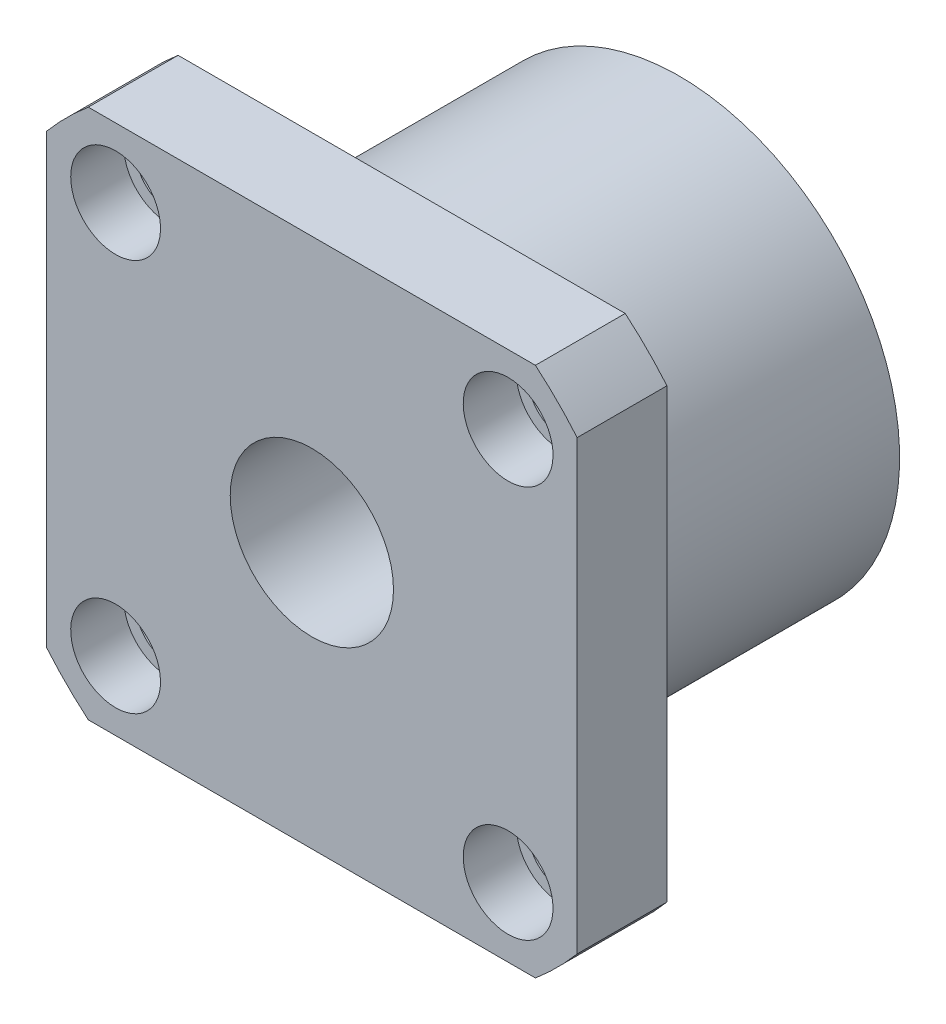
ISO-10303-21;
HEADER;
FILE_DESCRIPTION(('STEP AP214'),'2;1');
FILE_NAME('part.step','',(''),(''),'','','');
FILE_SCHEMA(('AUTOMOTIVE_DESIGN { 1 0 10303 214 1 1 1 1 }'));
ENDSEC;
DATA;
#1=APPLICATION_CONTEXT('core data for automotive mechanical design processes');
#2=APPLICATION_PROTOCOL_DEFINITION('international standard','automotive_design',2000,#1);
#3=PRODUCT_CONTEXT('',#1,'mechanical');
#4=PRODUCT('Part','Part','',(#3));
#5=PRODUCT_RELATED_PRODUCT_CATEGORY('part','',(#4));
#6=PRODUCT_DEFINITION_FORMATION('','',#4);
#7=PRODUCT_DEFINITION_CONTEXT('part definition',#1,'design');
#8=PRODUCT_DEFINITION('design','',#6,#7);
#9=PRODUCT_DEFINITION_SHAPE('','',#8);
#10=(LENGTH_UNIT() NAMED_UNIT(*) SI_UNIT(.MILLI.,.METRE.));
#11=(NAMED_UNIT(*) PLANE_ANGLE_UNIT() SI_UNIT($,.RADIAN.));
#12=(NAMED_UNIT(*) SI_UNIT($,.STERADIAN.) SOLID_ANGLE_UNIT());
#13=UNCERTAINTY_MEASURE_WITH_UNIT(LENGTH_MEASURE(1.E-05),#10,'distance_accuracy_value','');
#14=(GEOMETRIC_REPRESENTATION_CONTEXT(3) GLOBAL_UNCERTAINTY_ASSIGNED_CONTEXT((#13)) GLOBAL_UNIT_ASSIGNED_CONTEXT((#10,
#11,#12)) REPRESENTATION_CONTEXT('',''));
#15=CARTESIAN_POINT('',(0.,0.,0.));
#16=DIRECTION('',(0.,0.,1.));
#17=DIRECTION('',(1.,0.,0.));
#18=AXIS2_PLACEMENT_3D('',#15,#16,#17);
#19=CARTESIAN_POINT('',(0.,0.,0.));
#20=DIRECTION('',(0.,0.,-1.));
#21=DIRECTION('',(-1.,0.,0.));
#22=AXIS2_PLACEMENT_3D('',#19,#20,#21);
#23=PLANE('',#22);
#24=CARTESIAN_POINT('',(-24.041630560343,-24.0416305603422,0.));
#25=DIRECTION('',(0.,0.,-1.));
#26=DIRECTION('',(0.,-1.,0.));
#27=AXIS2_PLACEMENT_3D('',#24,#25,#26);
#28=CIRCLE('',#27,4.);
#29=CARTESIAN_POINT('',(-24.041630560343,-28.0416305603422,0.));
#30=VERTEX_POINT('',#29);
#31=EDGE_CURVE('E156',#30,#30,#28,.T.);
#32=ORIENTED_EDGE('',*,*,#31,.F.);
#33=EDGE_LOOP('',(#32));
#34=FACE_BOUND('',#33,.T.);
#35=CARTESIAN_POINT('',(24.0416305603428,24.0416305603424,0.));
#36=DIRECTION('',(0.,0.,-1.));
#37=DIRECTION('',(0.,1.,0.));
#38=AXIS2_PLACEMENT_3D('',#35,#36,#37);
#39=CIRCLE('',#38,4.);
#40=CARTESIAN_POINT('',(24.0416305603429,28.0416305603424,0.));
#41=VERTEX_POINT('',#40);
#42=EDGE_CURVE('E190',#41,#41,#39,.T.);
#43=ORIENTED_EDGE('',*,*,#42,.F.);
#44=EDGE_LOOP('',(#43));
#45=FACE_BOUND('',#44,.T.);
#46=CARTESIAN_POINT('',(0.,0.,0.));
#47=DIRECTION('',(0.,0.,-1.));
#48=DIRECTION('',(-1.,0.,0.));
#49=AXIS2_PLACEMENT_3D('',#46,#47,#48);
#50=CIRCLE('',#49,42.5);
#51=CARTESIAN_POINT('',(32.5,-27.3861278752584,0.));
#52=VERTEX_POINT('',#51);
#53=CARTESIAN_POINT('',(27.3861278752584,-32.5,0.));
#54=VERTEX_POINT('',#53);
#55=EDGE_CURVE('E80',#52,#54,#50,.T.);
#56=ORIENTED_EDGE('',*,*,#55,.T.);
#57=DIRECTION('',(1.,0.,0.));
#58=VECTOR('',#57,1.);
#59=CARTESIAN_POINT('',(-27.3861278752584,-32.5,0.));
#60=LINE('',#59,#58);
#61=CARTESIAN_POINT('',(-27.3861278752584,-32.5,0.));
#62=VERTEX_POINT('',#61);
#63=EDGE_CURVE('E94',#62,#54,#60,.T.);
#64=ORIENTED_EDGE('',*,*,#63,.F.);
#65=CARTESIAN_POINT('',(0.,0.,0.));
#66=DIRECTION('',(0.,0.,1.));
#67=DIRECTION('',(1.,0.,0.));
#68=AXIS2_PLACEMENT_3D('',#65,#66,#67);
#69=CIRCLE('',#68,42.5);
#70=CARTESIAN_POINT('',(-32.5,-27.3861278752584,0.));
#71=VERTEX_POINT('',#70);
#72=EDGE_CURVE('E101',#71,#62,#69,.T.);
#73=ORIENTED_EDGE('',*,*,#72,.F.);
#74=DIRECTION('',(0.,-1.,0.));
#75=VECTOR('',#74,1.);
#76=CARTESIAN_POINT('',(-32.5,27.3861278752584,0.));
#77=LINE('',#76,#75);
#78=CARTESIAN_POINT('',(-32.5,27.3861278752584,0.));
#79=VERTEX_POINT('',#78);
#80=EDGE_CURVE('E103',#79,#71,#77,.T.);
#81=ORIENTED_EDGE('',*,*,#80,.F.);
#82=CARTESIAN_POINT('',(0.,0.,0.));
#83=DIRECTION('',(0.,0.,-1.));
#84=DIRECTION('',(-1.,0.,0.));
#85=AXIS2_PLACEMENT_3D('',#82,#83,#84);
#86=CIRCLE('',#85,42.5);
#87=CARTESIAN_POINT('',(-27.3861278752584,32.5,0.));
#88=VERTEX_POINT('',#87);
#89=EDGE_CURVE('E109',#79,#88,#86,.T.);
#90=ORIENTED_EDGE('',*,*,#89,.T.);
#91=DIRECTION('',(1.,0.,0.));
#92=VECTOR('',#91,1.);
#93=CARTESIAN_POINT('',(-27.3861278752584,32.5,0.));
#94=LINE('',#93,#92);
#95=CARTESIAN_POINT('',(27.3861278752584,32.5,0.));
#96=VERTEX_POINT('',#95);
#97=EDGE_CURVE('E112',#88,#96,#94,.T.);
#98=ORIENTED_EDGE('',*,*,#97,.T.);
#99=CARTESIAN_POINT('',(0.,0.,0.));
#100=DIRECTION('',(0.,0.,1.));
#101=DIRECTION('',(1.,0.,0.));
#102=AXIS2_PLACEMENT_3D('',#99,#100,#101);
#103=CIRCLE('',#102,42.5);
#104=CARTESIAN_POINT('',(32.5,27.3861278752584,0.));
#105=VERTEX_POINT('',#104);
#106=EDGE_CURVE('E115',#105,#96,#103,.T.);
#107=ORIENTED_EDGE('',*,*,#106,.F.);
#108=DIRECTION('',(0.,-1.,0.));
#109=VECTOR('',#108,1.);
#110=CARTESIAN_POINT('',(32.5,27.3861278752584,0.));
#111=LINE('',#110,#109);
#112=EDGE_CURVE('E97',#105,#52,#111,.T.);
#113=ORIENTED_EDGE('',*,*,#112,.T.);
#114=EDGE_LOOP('',(#56,#64,#73,#81,#90,#98,#107,#113));
#115=FACE_BOUND('',#114,.T.);
#116=CARTESIAN_POINT('',(-24.0416305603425,24.0416305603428,0.));
#117=DIRECTION('',(0.,0.,-1.));
#118=DIRECTION('',(-1.,0.,0.));
#119=AXIS2_PLACEMENT_3D('',#116,#117,#118);
#120=CIRCLE('',#119,4.);
#121=CARTESIAN_POINT('',(-28.0416305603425,24.0416305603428,0.));
#122=VERTEX_POINT('',#121);
#123=EDGE_CURVE('E151',#122,#122,#120,.T.);
#124=ORIENTED_EDGE('',*,*,#123,.F.);
#125=EDGE_LOOP('',(#124));
#126=FACE_BOUND('',#125,.T.);
#127=CARTESIAN_POINT('',(24.0416305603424,-24.0416305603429,0.));
#128=DIRECTION('',(0.,0.,-1.));
#129=DIRECTION('',(1.,0.,0.));
#130=AXIS2_PLACEMENT_3D('',#127,#128,#129);
#131=CIRCLE('',#130,4.);
#132=CARTESIAN_POINT('',(28.0416305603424,-24.0416305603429,0.));
#133=VERTEX_POINT('',#132);
#134=EDGE_CURVE('E187',#133,#133,#131,.T.);
#135=ORIENTED_EDGE('',*,*,#134,.F.);
#136=EDGE_LOOP('',(#135));
#137=FACE_BOUND('',#136,.T.);
#138=CARTESIAN_POINT('',(0.,0.,0.));
#139=DIRECTION('',(0.,0.,-1.));
#140=DIRECTION('',(-1.,0.,0.));
#141=AXIS2_PLACEMENT_3D('',#138,#139,#140);
#142=CIRCLE('',#141,27.);
#143=CARTESIAN_POINT('',(-27.,0.,0.));
#144=VERTEX_POINT('',#143);
#145=EDGE_CURVE('E18',#144,#144,#142,.F.);
#146=ORIENTED_EDGE('',*,*,#145,.T.);
#147=EDGE_LOOP('',(#146));
#148=FACE_BOUND('',#147,.T.);
#149=ADVANCED_FACE('F14',(#34,#45,#115,#126,#137,#148),#23,.T.);
#150=CARTESIAN_POINT('',(0.,0.,11.));
#151=DIRECTION('',(0.,0.,-1.));
#152=DIRECTION('',(-1.,0.,0.));
#153=AXIS2_PLACEMENT_3D('',#150,#151,#152);
#154=PLANE('',#153);
#155=CARTESIAN_POINT('',(0.,0.,11.));
#156=DIRECTION('',(0.,0.,1.));
#157=DIRECTION('',(1.,0.,0.));
#158=AXIS2_PLACEMENT_3D('',#155,#156,#157);
#159=CIRCLE('',#158,10.);
#160=CARTESIAN_POINT('',(10.,0.,11.));
#161=VERTEX_POINT('',#160);
#162=EDGE_CURVE('E98',#161,#161,#159,.T.);
#163=ORIENTED_EDGE('',*,*,#162,.F.);
#164=EDGE_LOOP('',(#163));
#165=FACE_BOUND('',#164,.T.);
#166=CARTESIAN_POINT('',(-24.041630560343,-24.0416305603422,11.));
#167=DIRECTION('',(0.,0.,-1.));
#168=DIRECTION('',(0.,-1.,0.));
#169=AXIS2_PLACEMENT_3D('',#166,#167,#168);
#170=CIRCLE('',#169,5.5);
#171=CARTESIAN_POINT('',(-24.0416305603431,-29.5416305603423,11.));
#172=VERTEX_POINT('',#171);
#173=EDGE_CURVE('E171',#172,#172,#170,.T.);
#174=ORIENTED_EDGE('',*,*,#173,.T.);
#175=EDGE_LOOP('',(#174));
#176=FACE_BOUND('',#175,.T.);
#177=CARTESIAN_POINT('',(24.0416305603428,24.0416305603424,11.));
#178=DIRECTION('',(0.,0.,-1.));
#179=DIRECTION('',(0.,1.,0.));
#180=AXIS2_PLACEMENT_3D('',#177,#178,#179);
#181=CIRCLE('',#180,5.5);
#182=CARTESIAN_POINT('',(24.0416305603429,29.5416305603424,11.));
#183=VERTEX_POINT('',#182);
#184=EDGE_CURVE('E160',#183,#183,#181,.T.);
#185=ORIENTED_EDGE('',*,*,#184,.T.);
#186=EDGE_LOOP('',(#185));
#187=FACE_BOUND('',#186,.T.);
#188=CARTESIAN_POINT('',(-24.0416305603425,24.0416305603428,11.));
#189=DIRECTION('',(0.,0.,-1.));
#190=DIRECTION('',(-1.,0.,0.));
#191=AXIS2_PLACEMENT_3D('',#188,#189,#190);
#192=CIRCLE('',#191,5.5);
#193=CARTESIAN_POINT('',(-29.5416305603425,24.0416305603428,11.));
#194=VERTEX_POINT('',#193);
#195=EDGE_CURVE('E193',#194,#194,#192,.T.);
#196=ORIENTED_EDGE('',*,*,#195,.T.);
#197=EDGE_LOOP('',(#196));
#198=FACE_BOUND('',#197,.T.);
#199=CARTESIAN_POINT('',(0.,0.,11.));
#200=DIRECTION('',(0.,0.,-1.));
#201=DIRECTION('',(-1.,0.,0.));
#202=AXIS2_PLACEMENT_3D('',#199,#200,#201);
#203=CIRCLE('',#202,42.5);
#204=CARTESIAN_POINT('',(32.5,-27.3861278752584,11.));
#205=VERTEX_POINT('',#204);
#206=CARTESIAN_POINT('',(27.3861278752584,-32.5,11.));
#207=VERTEX_POINT('',#206);
#208=EDGE_CURVE('E82',#205,#207,#203,.T.);
#209=ORIENTED_EDGE('',*,*,#208,.F.);
#210=DIRECTION('',(0.,-1.,0.));
#211=VECTOR('',#210,1.);
#212=CARTESIAN_POINT('',(32.5,27.3861278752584,11.));
#213=LINE('',#212,#211);
#214=CARTESIAN_POINT('',(32.5,27.3861278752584,11.));
#215=VERTEX_POINT('',#214);
#216=EDGE_CURVE('E88',#215,#205,#213,.T.);
#217=ORIENTED_EDGE('',*,*,#216,.F.);
#218=CARTESIAN_POINT('',(0.,0.,11.));
#219=DIRECTION('',(0.,0.,1.));
#220=DIRECTION('',(1.,0.,0.));
#221=AXIS2_PLACEMENT_3D('',#218,#219,#220);
#222=CIRCLE('',#221,42.5);
#223=CARTESIAN_POINT('',(27.3861278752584,32.5,11.));
#224=VERTEX_POINT('',#223);
#225=EDGE_CURVE('E134',#215,#224,#222,.T.);
#226=ORIENTED_EDGE('',*,*,#225,.T.);
#227=DIRECTION('',(1.,0.,0.));
#228=VECTOR('',#227,1.);
#229=CARTESIAN_POINT('',(-27.3861278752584,32.5,11.));
#230=LINE('',#229,#228);
#231=CARTESIAN_POINT('',(-27.3861278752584,32.5,11.));
#232=VERTEX_POINT('',#231);
#233=EDGE_CURVE('E131',#232,#224,#230,.T.);
#234=ORIENTED_EDGE('',*,*,#233,.F.);
#235=CARTESIAN_POINT('',(0.,0.,11.));
#236=DIRECTION('',(0.,0.,-1.));
#237=DIRECTION('',(-1.,0.,0.));
#238=AXIS2_PLACEMENT_3D('',#235,#236,#237);
#239=CIRCLE('',#238,42.5);
#240=CARTESIAN_POINT('',(-32.5,27.3861278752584,11.));
#241=VERTEX_POINT('',#240);
#242=EDGE_CURVE('E128',#241,#232,#239,.T.);
#243=ORIENTED_EDGE('',*,*,#242,.F.);
#244=DIRECTION('',(0.,-1.,0.));
#245=VECTOR('',#244,1.);
#246=CARTESIAN_POINT('',(-32.5,27.3861278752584,11.));
#247=LINE('',#246,#245);
#248=CARTESIAN_POINT('',(-32.5,-27.3861278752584,11.));
#249=VERTEX_POINT('',#248);
#250=EDGE_CURVE('E125',#241,#249,#247,.T.);
#251=ORIENTED_EDGE('',*,*,#250,.T.);
#252=CARTESIAN_POINT('',(0.,0.,11.));
#253=DIRECTION('',(0.,0.,1.));
#254=DIRECTION('',(1.,0.,0.));
#255=AXIS2_PLACEMENT_3D('',#252,#253,#254);
#256=CIRCLE('',#255,42.5);
#257=CARTESIAN_POINT('',(-27.3861278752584,-32.5,11.));
#258=VERTEX_POINT('',#257);
#259=EDGE_CURVE('E122',#249,#258,#256,.T.);
#260=ORIENTED_EDGE('',*,*,#259,.T.);
#261=DIRECTION('',(1.,0.,0.));
#262=VECTOR('',#261,1.);
#263=CARTESIAN_POINT('',(-27.3861278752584,-32.5,11.));
#264=LINE('',#263,#262);
#265=EDGE_CURVE('E120',#258,#207,#264,.T.);
#266=ORIENTED_EDGE('',*,*,#265,.T.);
#267=EDGE_LOOP('',(#209,#217,#226,#234,#243,#251,#260,#266));
#268=FACE_BOUND('',#267,.T.);
#269=CARTESIAN_POINT('',(24.0416305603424,-24.0416305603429,11.));
#270=DIRECTION('',(0.,0.,-1.));
#271=DIRECTION('',(1.,0.,0.));
#272=AXIS2_PLACEMENT_3D('',#269,#270,#271);
#273=CIRCLE('',#272,5.5);
#274=CARTESIAN_POINT('',(29.5416305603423,-24.0416305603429,11.));
#275=VERTEX_POINT('',#274);
#276=EDGE_CURVE('E164',#275,#275,#273,.T.);
#277=ORIENTED_EDGE('',*,*,#276,.T.);
#278=EDGE_LOOP('',(#277));
#279=FACE_BOUND('',#278,.T.);
#280=ADVANCED_FACE('F205',(#165,#176,#187,#198,#268,#279),#154,.F.);
#281=CARTESIAN_POINT('',(0.,0.,11.));
#282=DIRECTION('',(0.,0.,-1.));
#283=DIRECTION('',(-1.,0.,0.));
#284=AXIS2_PLACEMENT_3D('',#281,#282,#283);
#285=CYLINDRICAL_SURFACE('',#284,42.5);
#286=DIRECTION('',(0.,0.,-1.));
#287=VECTOR('',#286,1.);
#288=CARTESIAN_POINT('',(32.5,-27.3861278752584,11.));
#289=LINE('',#288,#287);
#290=EDGE_CURVE('E9',#205,#52,#289,.T.);
#291=ORIENTED_EDGE('',*,*,#290,.F.);
#292=ORIENTED_EDGE('',*,*,#208,.T.);
#293=DIRECTION('',(0.,0.,-1.));
#294=VECTOR('',#293,1.);
#295=CARTESIAN_POINT('',(27.3861278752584,-32.5,11.));
#296=LINE('',#295,#294);
#297=EDGE_CURVE('E77',#207,#54,#296,.T.);
#298=ORIENTED_EDGE('',*,*,#297,.T.);
#299=ORIENTED_EDGE('',*,*,#55,.F.);
#300=EDGE_LOOP('',(#291,#292,#298,#299));
#301=FACE_BOUND('',#300,.T.);
#302=ADVANCED_FACE('F79',(#301),#285,.T.);
#303=CARTESIAN_POINT('',(32.5,27.3861278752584,11.));
#304=DIRECTION('',(1.,0.,0.));
#305=DIRECTION('',(0.,0.,-1.));
#306=AXIS2_PLACEMENT_3D('',#303,#304,#305);
#307=PLANE('',#306);
#308=DIRECTION('',(0.,0.,-1.));
#309=VECTOR('',#308,1.);
#310=CARTESIAN_POINT('',(32.5,27.3861278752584,11.));
#311=LINE('',#310,#309);
#312=EDGE_CURVE('E23',#215,#105,#311,.T.);
#313=ORIENTED_EDGE('',*,*,#312,.F.);
#314=ORIENTED_EDGE('',*,*,#216,.T.);
#315=ORIENTED_EDGE('',*,*,#290,.T.);
#316=ORIENTED_EDGE('',*,*,#112,.F.);
#317=EDGE_LOOP('',(#313,#314,#315,#316));
#318=FACE_BOUND('',#317,.T.);
#319=ADVANCED_FACE('F16',(#318),#307,.T.);
#320=CARTESIAN_POINT('',(0.,0.,11.));
#321=DIRECTION('',(0.,0.,-1.));
#322=DIRECTION('',(-1.,0.,0.));
#323=AXIS2_PLACEMENT_3D('',#320,#321,#322);
#324=CYLINDRICAL_SURFACE('',#323,42.5);
#325=DIRECTION('',(0.,0.,-1.));
#326=VECTOR('',#325,1.);
#327=CARTESIAN_POINT('',(27.3861278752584,32.5,11.));
#328=LINE('',#327,#326);
#329=EDGE_CURVE('E145',#224,#96,#328,.T.);
#330=ORIENTED_EDGE('',*,*,#329,.F.);
#331=ORIENTED_EDGE('',*,*,#225,.F.);
#332=ORIENTED_EDGE('',*,*,#312,.T.);
#333=ORIENTED_EDGE('',*,*,#106,.T.);
#334=EDGE_LOOP('',(#330,#331,#332,#333));
#335=FACE_BOUND('',#334,.T.);
#336=ADVANCED_FACE('F269',(#335),#324,.T.);
#337=CARTESIAN_POINT('',(-27.3861278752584,32.5,11.));
#338=DIRECTION('',(0.,1.,0.));
#339=DIRECTION('',(0.,0.,1.));
#340=AXIS2_PLACEMENT_3D('',#337,#338,#339);
#341=PLANE('',#340);
#342=DIRECTION('',(0.,0.,-1.));
#343=VECTOR('',#342,1.);
#344=CARTESIAN_POINT('',(-27.3861278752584,32.5,11.));
#345=LINE('',#344,#343);
#346=EDGE_CURVE('E143',#232,#88,#345,.T.);
#347=ORIENTED_EDGE('',*,*,#346,.F.);
#348=ORIENTED_EDGE('',*,*,#233,.T.);
#349=ORIENTED_EDGE('',*,*,#329,.T.);
#350=ORIENTED_EDGE('',*,*,#97,.F.);
#351=EDGE_LOOP('',(#347,#348,#349,#350));
#352=FACE_BOUND('',#351,.T.);
#353=ADVANCED_FACE('F266',(#352),#341,.T.);
#354=CARTESIAN_POINT('',(0.,0.,11.));
#355=DIRECTION('',(0.,0.,-1.));
#356=DIRECTION('',(-1.,0.,0.));
#357=AXIS2_PLACEMENT_3D('',#354,#355,#356);
#358=CYLINDRICAL_SURFACE('',#357,42.5);
#359=DIRECTION('',(0.,0.,-1.));
#360=VECTOR('',#359,1.);
#361=CARTESIAN_POINT('',(-32.5,27.3861278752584,11.));
#362=LINE('',#361,#360);
#363=EDGE_CURVE('E141',#241,#79,#362,.T.);
#364=ORIENTED_EDGE('',*,*,#363,.F.);
#365=ORIENTED_EDGE('',*,*,#242,.T.);
#366=ORIENTED_EDGE('',*,*,#346,.T.);
#367=ORIENTED_EDGE('',*,*,#89,.F.);
#368=EDGE_LOOP('',(#364,#365,#366,#367));
#369=FACE_BOUND('',#368,.T.);
#370=ADVANCED_FACE('F262',(#369),#358,.T.);
#371=CARTESIAN_POINT('',(-32.5,27.3861278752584,11.));
#372=DIRECTION('',(1.,0.,0.));
#373=DIRECTION('',(0.,0.,-1.));
#374=AXIS2_PLACEMENT_3D('',#371,#372,#373);
#375=PLANE('',#374);
#376=DIRECTION('',(0.,0.,-1.));
#377=VECTOR('',#376,1.);
#378=CARTESIAN_POINT('',(-32.5,-27.3861278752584,11.));
#379=LINE('',#378,#377);
#380=EDGE_CURVE('E139',#249,#71,#379,.T.);
#381=ORIENTED_EDGE('',*,*,#380,.F.);
#382=ORIENTED_EDGE('',*,*,#250,.F.);
#383=ORIENTED_EDGE('',*,*,#363,.T.);
#384=ORIENTED_EDGE('',*,*,#80,.T.);
#385=EDGE_LOOP('',(#381,#382,#383,#384));
#386=FACE_BOUND('',#385,.T.);
#387=ADVANCED_FACE('F258',(#386),#375,.F.);
#388=CARTESIAN_POINT('',(0.,0.,11.));
#389=DIRECTION('',(0.,0.,-1.));
#390=DIRECTION('',(-1.,0.,0.));
#391=AXIS2_PLACEMENT_3D('',#388,#389,#390);
#392=CYLINDRICAL_SURFACE('',#391,42.5);
#393=DIRECTION('',(0.,0.,-1.));
#394=VECTOR('',#393,1.);
#395=CARTESIAN_POINT('',(-27.3861278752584,-32.5,11.));
#396=LINE('',#395,#394);
#397=EDGE_CURVE('E87',#258,#62,#396,.T.);
#398=ORIENTED_EDGE('',*,*,#397,.F.);
#399=ORIENTED_EDGE('',*,*,#259,.F.);
#400=ORIENTED_EDGE('',*,*,#380,.T.);
#401=ORIENTED_EDGE('',*,*,#72,.T.);
#402=EDGE_LOOP('',(#398,#399,#400,#401));
#403=FACE_BOUND('',#402,.T.);
#404=ADVANCED_FACE('F255',(#403),#392,.T.);
#405=CARTESIAN_POINT('',(-27.3861278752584,-32.5,11.));
#406=DIRECTION('',(0.,1.,0.));
#407=DIRECTION('',(0.,0.,1.));
#408=AXIS2_PLACEMENT_3D('',#405,#406,#407);
#409=PLANE('',#408);
#410=ORIENTED_EDGE('',*,*,#265,.F.);
#411=ORIENTED_EDGE('',*,*,#397,.T.);
#412=ORIENTED_EDGE('',*,*,#63,.T.);
#413=ORIENTED_EDGE('',*,*,#297,.F.);
#414=EDGE_LOOP('',(#410,#411,#412,#413));
#415=FACE_BOUND('',#414,.T.);
#416=ADVANCED_FACE('F100',(#415),#409,.F.);
#417=CARTESIAN_POINT('',(0.,0.,11.));
#418=DIRECTION('',(0.,0.,-1.));
#419=DIRECTION('',(-1.,0.,0.));
#420=AXIS2_PLACEMENT_3D('',#417,#418,#419);
#421=CYLINDRICAL_SURFACE('',#420,10.);
#422=ORIENTED_EDGE('',*,*,#162,.T.);
#423=EDGE_LOOP('',(#422));
#424=FACE_BOUND('',#423,.T.);
#425=CARTESIAN_POINT('',(0.,0.,-34.));
#426=DIRECTION('',(0.,0.,-1.));
#427=DIRECTION('',(-1.,0.,0.));
#428=AXIS2_PLACEMENT_3D('',#425,#426,#427);
#429=CIRCLE('',#428,10.);
#430=CARTESIAN_POINT('',(-10.,0.,-34.));
#431=VERTEX_POINT('',#430);
#432=EDGE_CURVE('E475',#431,#431,#429,.T.);
#433=ORIENTED_EDGE('',*,*,#432,.T.);
#434=EDGE_LOOP('',(#433));
#435=FACE_BOUND('',#434,.T.);
#436=ADVANCED_FACE('F202',(#424,#435),#421,.F.);
#437=CARTESIAN_POINT('',(-24.0416305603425,24.0416305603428,0.));
#438=DIRECTION('',(0.,0.,1.));
#439=DIRECTION('',(1.,0.,0.));
#440=AXIS2_PLACEMENT_3D('',#437,#438,#439);
#441=CYLINDRICAL_SURFACE('',#440,4.);
#442=CARTESIAN_POINT('',(-24.0416305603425,24.0416305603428,4.5));
#443=DIRECTION('',(0.,0.,-1.));
#444=DIRECTION('',(-1.,0.,0.));
#445=AXIS2_PLACEMENT_3D('',#442,#443,#444);
#446=CIRCLE('',#445,4.);
#447=CARTESIAN_POINT('',(-28.0416305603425,24.0416305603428,4.5));
#448=VERTEX_POINT('',#447);
#449=EDGE_CURVE('E148',#448,#448,#446,.T.);
#450=ORIENTED_EDGE('',*,*,#449,.F.);
#451=EDGE_LOOP('',(#450));
#452=FACE_BOUND('',#451,.T.);
#453=ORIENTED_EDGE('',*,*,#123,.T.);
#454=EDGE_LOOP('',(#453));
#455=FACE_BOUND('',#454,.T.);
#456=ADVANCED_FACE('F351',(#452,#455),#441,.F.);
#457=CARTESIAN_POINT('',(-24.0416305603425,24.0416305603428,4.5));
#458=DIRECTION('',(0.,0.,1.));
#459=DIRECTION('',(1.,0.,0.));
#460=AXIS2_PLACEMENT_3D('',#457,#458,#459);
#461=CYLINDRICAL_SURFACE('',#460,5.5);
#462=CARTESIAN_POINT('',(-24.0416305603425,24.0416305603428,4.5));
#463=DIRECTION('',(0.,0.,-1.));
#464=DIRECTION('',(-1.,0.,0.));
#465=AXIS2_PLACEMENT_3D('',#462,#463,#464);
#466=CIRCLE('',#465,5.5);
#467=CARTESIAN_POINT('',(-29.5416305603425,24.0416305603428,4.5));
#468=VERTEX_POINT('',#467);
#469=EDGE_CURVE('E152',#468,#468,#466,.T.);
#470=ORIENTED_EDGE('',*,*,#469,.T.);
#471=EDGE_LOOP('',(#470));
#472=FACE_BOUND('',#471,.T.);
#473=ORIENTED_EDGE('',*,*,#195,.F.);
#474=EDGE_LOOP('',(#473));
#475=FACE_BOUND('',#474,.T.);
#476=ADVANCED_FACE('F358',(#472,#475),#461,.F.);
#477=CARTESIAN_POINT('',(-24.0416305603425,24.0416305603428,4.5));
#478=DIRECTION('',(0.,0.,-1.));
#479=DIRECTION('',(-1.,0.,0.));
#480=AXIS2_PLACEMENT_3D('',#477,#478,#479);
#481=PLANE('',#480);
#482=ORIENTED_EDGE('',*,*,#449,.T.);
#483=EDGE_LOOP('',(#482));
#484=FACE_BOUND('',#483,.T.);
#485=ORIENTED_EDGE('',*,*,#469,.F.);
#486=EDGE_LOOP('',(#485));
#487=FACE_BOUND('',#486,.T.);
#488=ADVANCED_FACE('F360',(#484,#487),#481,.F.);
#489=CARTESIAN_POINT('',(24.0416305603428,24.0416305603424,0.));
#490=DIRECTION('',(0.,0.,1.));
#491=DIRECTION('',(1.,0.,0.));
#492=AXIS2_PLACEMENT_3D('',#489,#490,#491);
#493=CYLINDRICAL_SURFACE('',#492,4.);
#494=CARTESIAN_POINT('',(24.0416305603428,24.0416305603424,4.5));
#495=DIRECTION('',(0.,0.,-1.));
#496=DIRECTION('',(-1.,0.,0.));
#497=AXIS2_PLACEMENT_3D('',#494,#495,#496);
#498=CIRCLE('',#497,4.);
#499=CARTESIAN_POINT('',(20.0416305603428,24.0416305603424,4.5));
#500=VERTEX_POINT('',#499);
#501=EDGE_CURVE('E153',#500,#500,#498,.T.);
#502=ORIENTED_EDGE('',*,*,#501,.F.);
#503=EDGE_LOOP('',(#502));
#504=FACE_BOUND('',#503,.T.);
#505=ORIENTED_EDGE('',*,*,#42,.T.);
#506=EDGE_LOOP('',(#505));
#507=FACE_BOUND('',#506,.T.);
#508=ADVANCED_FACE('F369',(#504,#507),#493,.F.);
#509=CARTESIAN_POINT('',(24.0416305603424,-24.0416305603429,0.));
#510=DIRECTION('',(0.,0.,1.));
#511=DIRECTION('',(1.,0.,0.));
#512=AXIS2_PLACEMENT_3D('',#509,#510,#511);
#513=CYLINDRICAL_SURFACE('',#512,4.);
#514=CARTESIAN_POINT('',(24.0416305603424,-24.0416305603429,4.5));
#515=DIRECTION('',(0.,0.,-1.));
#516=DIRECTION('',(-1.,0.,0.));
#517=AXIS2_PLACEMENT_3D('',#514,#515,#516);
#518=CIRCLE('',#517,4.);
#519=CARTESIAN_POINT('',(20.0416305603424,-24.0416305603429,4.5));
#520=VERTEX_POINT('',#519);
#521=EDGE_CURVE('E158',#520,#520,#518,.T.);
#522=ORIENTED_EDGE('',*,*,#521,.F.);
#523=EDGE_LOOP('',(#522));
#524=FACE_BOUND('',#523,.T.);
#525=ORIENTED_EDGE('',*,*,#134,.T.);
#526=EDGE_LOOP('',(#525));
#527=FACE_BOUND('',#526,.T.);
#528=ADVANCED_FACE('F384',(#524,#527),#513,.F.);
#529=CARTESIAN_POINT('',(-24.041630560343,-24.0416305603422,0.));
#530=DIRECTION('',(0.,0.,1.));
#531=DIRECTION('',(1.,0.,0.));
#532=AXIS2_PLACEMENT_3D('',#529,#530,#531);
#533=CYLINDRICAL_SURFACE('',#532,4.);
#534=CARTESIAN_POINT('',(-24.041630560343,-24.0416305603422,4.5));
#535=DIRECTION('',(0.,0.,-1.));
#536=DIRECTION('',(-1.,0.,0.));
#537=AXIS2_PLACEMENT_3D('',#534,#535,#536);
#538=CIRCLE('',#537,4.);
#539=CARTESIAN_POINT('',(-28.041630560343,-24.0416305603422,4.5));
#540=VERTEX_POINT('',#539);
#541=EDGE_CURVE('E162',#540,#540,#538,.T.);
#542=ORIENTED_EDGE('',*,*,#541,.F.);
#543=EDGE_LOOP('',(#542));
#544=FACE_BOUND('',#543,.T.);
#545=ORIENTED_EDGE('',*,*,#31,.T.);
#546=EDGE_LOOP('',(#545));
#547=FACE_BOUND('',#546,.T.);
#548=ADVANCED_FACE('F237',(#544,#547),#533,.F.);
#549=CARTESIAN_POINT('',(24.0416305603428,24.0416305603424,4.5));
#550=DIRECTION('',(0.,0.,1.));
#551=DIRECTION('',(1.,0.,0.));
#552=AXIS2_PLACEMENT_3D('',#549,#550,#551);
#553=CYLINDRICAL_SURFACE('',#552,5.5);
#554=CARTESIAN_POINT('',(24.0416305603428,24.0416305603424,4.5));
#555=DIRECTION('',(0.,0.,-1.));
#556=DIRECTION('',(0.,1.,0.));
#557=AXIS2_PLACEMENT_3D('',#554,#555,#556);
#558=CIRCLE('',#557,5.5);
#559=CARTESIAN_POINT('',(24.0416305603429,29.5416305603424,4.5));
#560=VERTEX_POINT('',#559);
#561=EDGE_CURVE('E157',#560,#560,#558,.T.);
#562=ORIENTED_EDGE('',*,*,#561,.T.);
#563=EDGE_LOOP('',(#562));
#564=FACE_BOUND('',#563,.T.);
#565=ORIENTED_EDGE('',*,*,#184,.F.);
#566=EDGE_LOOP('',(#565));
#567=FACE_BOUND('',#566,.T.);
#568=ADVANCED_FACE('F234',(#564,#567),#553,.F.);
#569=CARTESIAN_POINT('',(24.0416305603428,24.0416305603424,4.5));
#570=DIRECTION('',(0.,0.,-1.));
#571=DIRECTION('',(0.,1.,0.));
#572=AXIS2_PLACEMENT_3D('',#569,#570,#571);
#573=PLANE('',#572);
#574=ORIENTED_EDGE('',*,*,#501,.T.);
#575=EDGE_LOOP('',(#574));
#576=FACE_BOUND('',#575,.T.);
#577=ORIENTED_EDGE('',*,*,#561,.F.);
#578=EDGE_LOOP('',(#577));
#579=FACE_BOUND('',#578,.T.);
#580=ADVANCED_FACE('F222',(#576,#579),#573,.F.);
#581=CARTESIAN_POINT('',(24.0416305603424,-24.0416305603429,4.5));
#582=DIRECTION('',(0.,0.,1.));
#583=DIRECTION('',(1.,0.,0.));
#584=AXIS2_PLACEMENT_3D('',#581,#582,#583);
#585=CYLINDRICAL_SURFACE('',#584,5.5);
#586=CARTESIAN_POINT('',(24.0416305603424,-24.0416305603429,4.5));
#587=DIRECTION('',(0.,0.,-1.));
#588=DIRECTION('',(1.,0.,0.));
#589=AXIS2_PLACEMENT_3D('',#586,#587,#588);
#590=CIRCLE('',#589,5.5);
#591=CARTESIAN_POINT('',(29.5416305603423,-24.0416305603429,4.5));
#592=VERTEX_POINT('',#591);
#593=EDGE_CURVE('E161',#592,#592,#590,.T.);
#594=ORIENTED_EDGE('',*,*,#593,.T.);
#595=EDGE_LOOP('',(#594));
#596=FACE_BOUND('',#595,.T.);
#597=ORIENTED_EDGE('',*,*,#276,.F.);
#598=EDGE_LOOP('',(#597));
#599=FACE_BOUND('',#598,.T.);
#600=ADVANCED_FACE('F219',(#596,#599),#585,.F.);
#601=CARTESIAN_POINT('',(24.0416305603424,-24.0416305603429,4.5));
#602=DIRECTION('',(0.,0.,-1.));
#603=DIRECTION('',(1.,0.,0.));
#604=AXIS2_PLACEMENT_3D('',#601,#602,#603);
#605=PLANE('',#604);
#606=ORIENTED_EDGE('',*,*,#521,.T.);
#607=EDGE_LOOP('',(#606));
#608=FACE_BOUND('',#607,.T.);
#609=ORIENTED_EDGE('',*,*,#593,.F.);
#610=EDGE_LOOP('',(#609));
#611=FACE_BOUND('',#610,.T.);
#612=ADVANCED_FACE('F221',(#608,#611),#605,.F.);
#613=CARTESIAN_POINT('',(-24.041630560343,-24.0416305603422,4.5));
#614=DIRECTION('',(0.,0.,1.));
#615=DIRECTION('',(1.,0.,0.));
#616=AXIS2_PLACEMENT_3D('',#613,#614,#615);
#617=CYLINDRICAL_SURFACE('',#616,5.5);
#618=CARTESIAN_POINT('',(-24.041630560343,-24.0416305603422,4.5));
#619=DIRECTION('',(0.,0.,-1.));
#620=DIRECTION('',(0.,-1.,0.));
#621=AXIS2_PLACEMENT_3D('',#618,#619,#620);
#622=CIRCLE('',#621,5.5);
#623=CARTESIAN_POINT('',(-24.0416305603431,-29.5416305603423,4.5));
#624=VERTEX_POINT('',#623);
#625=EDGE_CURVE('E165',#624,#624,#622,.T.);
#626=ORIENTED_EDGE('',*,*,#625,.T.);
#627=EDGE_LOOP('',(#626));
#628=FACE_BOUND('',#627,.T.);
#629=ORIENTED_EDGE('',*,*,#173,.F.);
#630=EDGE_LOOP('',(#629));
#631=FACE_BOUND('',#630,.T.);
#632=ADVANCED_FACE('F231',(#628,#631),#617,.F.);
#633=CARTESIAN_POINT('',(-24.041630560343,-24.0416305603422,4.5));
#634=DIRECTION('',(0.,0.,-1.));
#635=DIRECTION('',(0.,-1.,0.));
#636=AXIS2_PLACEMENT_3D('',#633,#634,#635);
#637=PLANE('',#636);
#638=ORIENTED_EDGE('',*,*,#541,.T.);
#639=EDGE_LOOP('',(#638));
#640=FACE_BOUND('',#639,.T.);
#641=ORIENTED_EDGE('',*,*,#625,.F.);
#642=EDGE_LOOP('',(#641));
#643=FACE_BOUND('',#642,.T.);
#644=ADVANCED_FACE('F225',(#640,#643),#637,.F.);
#645=CARTESIAN_POINT('',(0.,0.,-34.));
#646=DIRECTION('',(0.,0.,-1.));
#647=DIRECTION('',(-1.,0.,0.));
#648=AXIS2_PLACEMENT_3D('',#645,#646,#647);
#649=PLANE('',#648);
#650=CARTESIAN_POINT('',(0.,0.,-34.));
#651=DIRECTION('',(0.,0.,-1.));
#652=DIRECTION('',(-1.,0.,0.));
#653=AXIS2_PLACEMENT_3D('',#650,#651,#652);
#654=CIRCLE('',#653,27.);
#655=CARTESIAN_POINT('',(-27.,0.,-34.));
#656=VERTEX_POINT('',#655);
#657=EDGE_CURVE('E474',#656,#656,#654,.T.);
#658=ORIENTED_EDGE('',*,*,#657,.T.);
#659=EDGE_LOOP('',(#658));
#660=FACE_BOUND('',#659,.T.);
#661=ORIENTED_EDGE('',*,*,#432,.F.);
#662=EDGE_LOOP('',(#661));
#663=FACE_BOUND('',#662,.T.);
#664=ADVANCED_FACE('F239',(#660,#663),#649,.T.);
#665=CARTESIAN_POINT('',(0.,0.,-34.));
#666=DIRECTION('',(0.,0.,1.));
#667=DIRECTION('',(1.,0.,0.));
#668=AXIS2_PLACEMENT_3D('',#665,#666,#667);
#669=CYLINDRICAL_SURFACE('',#668,27.);
#670=ORIENTED_EDGE('',*,*,#145,.F.);
#671=EDGE_LOOP('',(#670));
#672=FACE_BOUND('',#671,.T.);
#673=ORIENTED_EDGE('',*,*,#657,.F.);
#674=EDGE_LOOP('',(#673));
#675=FACE_BOUND('',#674,.T.);
#676=ADVANCED_FACE('F426',(#672,#675),#669,.T.);
#677=CLOSED_SHELL('',(#149,#280,#302,#319,#336,#353,#370,#387,#404,#416,#436,#456,#476,#488,
#508,#528,#548,#568,#580,#600,#612,#632,#644,#664,#676));
#678=MANIFOLD_SOLID_BREP('B1',#677);
#679=ADVANCED_BREP_SHAPE_REPRESENTATION('',(#18,#678),#14);
#680=SHAPE_DEFINITION_REPRESENTATION(#9,#679);
ENDSEC;
END-ISO-10303-21;
